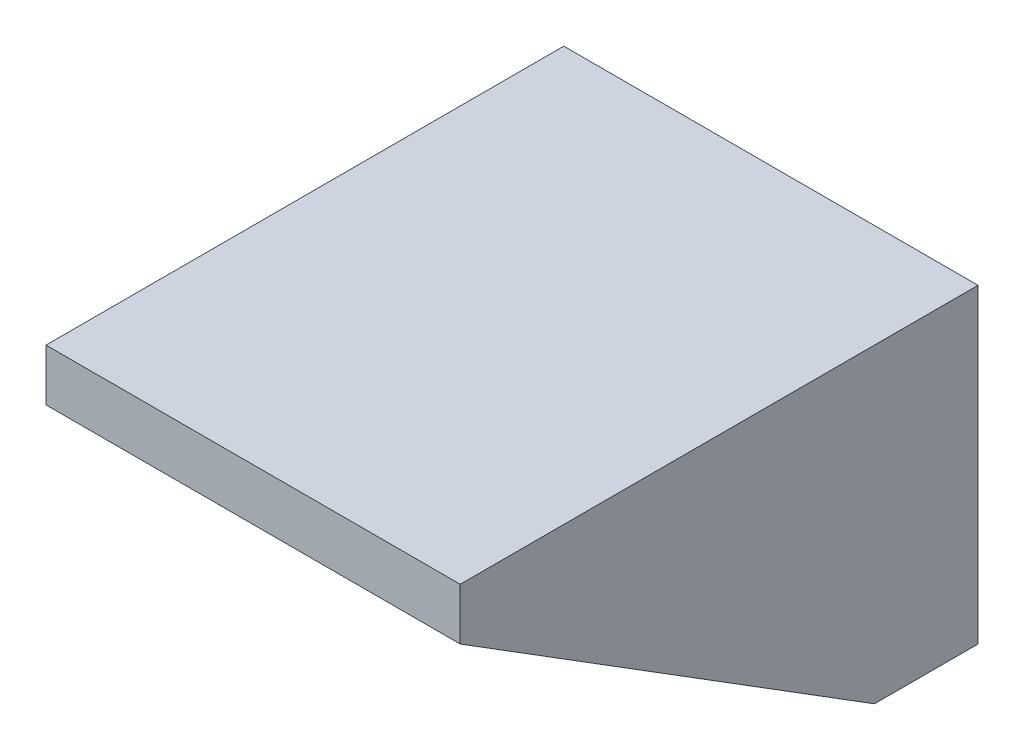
from build123d import *

# Parameters (mm, degrees)
ESQUISSE1_W      = 80
ESQUISSE1_H      = 60
EXTRUSION1_DEPTH = 20
EXTRUSION2_DEPTH = 80


with BuildPart() as part:
    # Esquisse1 → Extrusion1 (new body)
    with BuildSketch(Plane.XY):
        with Locations((0, -30)):
            Rectangle(ESQUISSE1_W, ESQUISSE1_H)
    extrude(amount=EXTRUSION1_DEPTH)

    # Esquisse2 → Extrusion2 (add)
    with BuildSketch(Plane(origin=(40, 0, 0), x_dir=(0, 0, -1), z_dir=(1, 0, 0))):
        Polygon((-20, -60), (-20, 0), (-100, 0), (-100, -10), align=None)
    extrude(amount=-EXTRUSION2_DEPTH)


solid = part.part
